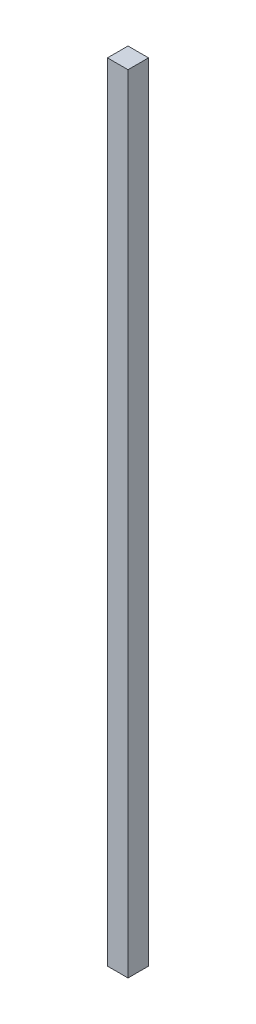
ISO-10303-21;
HEADER;
FILE_DESCRIPTION(('STEP AP214'),'2;1');
FILE_NAME('part.step','',(''),(''),'','','');
FILE_SCHEMA(('AUTOMOTIVE_DESIGN { 1 0 10303 214 1 1 1 1 }'));
ENDSEC;
DATA;
#1=APPLICATION_CONTEXT('core data for automotive mechanical design processes');
#2=APPLICATION_PROTOCOL_DEFINITION('international standard','automotive_design',2000,#1);
#3=PRODUCT_CONTEXT('',#1,'mechanical');
#4=PRODUCT('Part','Part','',(#3));
#5=PRODUCT_RELATED_PRODUCT_CATEGORY('part','',(#4));
#6=PRODUCT_DEFINITION_FORMATION('','',#4);
#7=PRODUCT_DEFINITION_CONTEXT('part definition',#1,'design');
#8=PRODUCT_DEFINITION('design','',#6,#7);
#9=PRODUCT_DEFINITION_SHAPE('','',#8);
#10=(LENGTH_UNIT() NAMED_UNIT(*) SI_UNIT(.MILLI.,.METRE.));
#11=(NAMED_UNIT(*) PLANE_ANGLE_UNIT() SI_UNIT($,.RADIAN.));
#12=(NAMED_UNIT(*) SI_UNIT($,.STERADIAN.) SOLID_ANGLE_UNIT());
#13=UNCERTAINTY_MEASURE_WITH_UNIT(LENGTH_MEASURE(1.E-05),#10,'distance_accuracy_value','');
#14=(GEOMETRIC_REPRESENTATION_CONTEXT(3) GLOBAL_UNCERTAINTY_ASSIGNED_CONTEXT((#13)) GLOBAL_UNIT_ASSIGNED_CONTEXT((#10,
#11,#12)) REPRESENTATION_CONTEXT('',''));
#15=CARTESIAN_POINT('',(0.,0.,0.));
#16=DIRECTION('',(0.,0.,1.));
#17=DIRECTION('',(1.,0.,0.));
#18=AXIS2_PLACEMENT_3D('',#15,#16,#17);
#19=CARTESIAN_POINT('',(30.,2300.,-30.));
#20=DIRECTION('',(-1.,0.,0.));
#21=DIRECTION('',(0.,0.,1.));
#22=AXIS2_PLACEMENT_3D('',#19,#20,#21);
#23=PLANE('',#22);
#24=DIRECTION('',(0.,0.,-1.));
#25=VECTOR('',#24,1.);
#26=CARTESIAN_POINT('',(30.,0.,-30.));
#27=LINE('',#26,#25);
#28=CARTESIAN_POINT('',(30.,0.,30.));
#29=VERTEX_POINT('',#28);
#30=CARTESIAN_POINT('',(30.,0.,-30.));
#31=VERTEX_POINT('',#30);
#32=EDGE_CURVE('E108',#29,#31,#27,.T.);
#33=ORIENTED_EDGE('',*,*,#32,.T.);
#34=DIRECTION('',(0.,-1.,0.));
#35=VECTOR('',#34,1.);
#36=CARTESIAN_POINT('',(30.,2300.,-30.));
#37=LINE('',#36,#35);
#38=CARTESIAN_POINT('',(30.,2300.,-30.));
#39=VERTEX_POINT('',#38);
#40=EDGE_CURVE('E11',#39,#31,#37,.T.);
#41=ORIENTED_EDGE('',*,*,#40,.F.);
#42=DIRECTION('',(0.,0.,-1.));
#43=VECTOR('',#42,1.);
#44=CARTESIAN_POINT('',(30.,2300.,-30.));
#45=LINE('',#44,#43);
#46=CARTESIAN_POINT('',(30.,2300.,30.));
#47=VERTEX_POINT('',#46);
#48=EDGE_CURVE('E96',#47,#39,#45,.T.);
#49=ORIENTED_EDGE('',*,*,#48,.F.);
#50=DIRECTION('',(0.,-1.,0.));
#51=VECTOR('',#50,1.);
#52=CARTESIAN_POINT('',(30.,2300.,30.));
#53=LINE('',#52,#51);
#54=EDGE_CURVE('E104',#47,#29,#53,.T.);
#55=ORIENTED_EDGE('',*,*,#54,.T.);
#56=EDGE_LOOP('',(#33,#41,#49,#55));
#57=FACE_BOUND('',#56,.T.);
#58=ADVANCED_FACE('F45',(#57),#23,.F.);
#59=CARTESIAN_POINT('',(-30.,2300.,-30.));
#60=DIRECTION('',(0.,0.,1.));
#61=DIRECTION('',(1.,0.,0.));
#62=AXIS2_PLACEMENT_3D('',#59,#60,#61);
#63=PLANE('',#62);
#64=DIRECTION('',(-1.,0.,0.));
#65=VECTOR('',#64,1.);
#66=CARTESIAN_POINT('',(-30.,0.,-30.));
#67=LINE('',#66,#65);
#68=CARTESIAN_POINT('',(-30.,0.,-30.));
#69=VERTEX_POINT('',#68);
#70=EDGE_CURVE('E100',#31,#69,#67,.T.);
#71=ORIENTED_EDGE('',*,*,#70,.T.);
#72=DIRECTION('',(0.,-1.,0.));
#73=VECTOR('',#72,1.);
#74=CARTESIAN_POINT('',(-30.,2300.,-30.));
#75=LINE('',#74,#73);
#76=CARTESIAN_POINT('',(-30.,2300.,-30.));
#77=VERTEX_POINT('',#76);
#78=EDGE_CURVE('E53',#77,#69,#75,.T.);
#79=ORIENTED_EDGE('',*,*,#78,.F.);
#80=DIRECTION('',(-1.,0.,0.));
#81=VECTOR('',#80,1.);
#82=CARTESIAN_POINT('',(-30.,2300.,-30.));
#83=LINE('',#82,#81);
#84=EDGE_CURVE('E91',#39,#77,#83,.T.);
#85=ORIENTED_EDGE('',*,*,#84,.F.);
#86=ORIENTED_EDGE('',*,*,#40,.T.);
#87=EDGE_LOOP('',(#71,#79,#85,#86));
#88=FACE_BOUND('',#87,.T.);
#89=ADVANCED_FACE('F99',(#88),#63,.F.);
#90=CARTESIAN_POINT('',(-30.,2300.,-30.));
#91=DIRECTION('',(1.,0.,0.));
#92=DIRECTION('',(0.,0.,-1.));
#93=AXIS2_PLACEMENT_3D('',#90,#91,#92);
#94=PLANE('',#93);
#95=DIRECTION('',(0.,0.,1.));
#96=VECTOR('',#95,1.);
#97=CARTESIAN_POINT('',(-30.,0.,-30.));
#98=LINE('',#97,#96);
#99=CARTESIAN_POINT('',(-30.,0.,30.));
#100=VERTEX_POINT('',#99);
#101=EDGE_CURVE('E78',#69,#100,#98,.T.);
#102=ORIENTED_EDGE('',*,*,#101,.T.);
#103=DIRECTION('',(0.,-1.,0.));
#104=VECTOR('',#103,1.);
#105=CARTESIAN_POINT('',(-30.,2300.,30.));
#106=LINE('',#105,#104);
#107=CARTESIAN_POINT('',(-30.,2300.,30.));
#108=VERTEX_POINT('',#107);
#109=EDGE_CURVE('E101',#108,#100,#106,.T.);
#110=ORIENTED_EDGE('',*,*,#109,.F.);
#111=DIRECTION('',(0.,0.,1.));
#112=VECTOR('',#111,1.);
#113=CARTESIAN_POINT('',(-30.,2300.,-30.));
#114=LINE('',#113,#112);
#115=EDGE_CURVE('E94',#77,#108,#114,.T.);
#116=ORIENTED_EDGE('',*,*,#115,.F.);
#117=ORIENTED_EDGE('',*,*,#78,.T.);
#118=EDGE_LOOP('',(#102,#110,#116,#117));
#119=FACE_BOUND('',#118,.T.);
#120=ADVANCED_FACE('F102',(#119),#94,.F.);
#121=CARTESIAN_POINT('',(-30.,2300.,30.));
#122=DIRECTION('',(0.,0.,-1.));
#123=DIRECTION('',(-1.,0.,0.));
#124=AXIS2_PLACEMENT_3D('',#121,#122,#123);
#125=PLANE('',#124);
#126=DIRECTION('',(1.,0.,0.));
#127=VECTOR('',#126,1.);
#128=CARTESIAN_POINT('',(-30.,0.,30.));
#129=LINE('',#128,#127);
#130=EDGE_CURVE('E84',#100,#29,#129,.T.);
#131=ORIENTED_EDGE('',*,*,#130,.T.);
#132=ORIENTED_EDGE('',*,*,#54,.F.);
#133=DIRECTION('',(1.,0.,0.));
#134=VECTOR('',#133,1.);
#135=CARTESIAN_POINT('',(-30.,2300.,30.));
#136=LINE('',#135,#134);
#137=EDGE_CURVE('E61',#108,#47,#136,.T.);
#138=ORIENTED_EDGE('',*,*,#137,.F.);
#139=ORIENTED_EDGE('',*,*,#109,.T.);
#140=EDGE_LOOP('',(#131,#132,#138,#139));
#141=FACE_BOUND('',#140,.T.);
#142=ADVANCED_FACE('F115',(#141),#125,.F.);
#143=CARTESIAN_POINT('',(0.,2300.,0.));
#144=DIRECTION('',(0.,1.,0.));
#145=DIRECTION('',(0.,0.,1.));
#146=AXIS2_PLACEMENT_3D('',#143,#144,#145);
#147=PLANE('',#146);
#148=ORIENTED_EDGE('',*,*,#48,.T.);
#149=ORIENTED_EDGE('',*,*,#84,.T.);
#150=ORIENTED_EDGE('',*,*,#115,.T.);
#151=ORIENTED_EDGE('',*,*,#137,.T.);
#152=EDGE_LOOP('',(#148,#149,#150,#151));
#153=FACE_BOUND('',#152,.T.);
#154=ADVANCED_FACE('F92',(#153),#147,.T.);
#155=CARTESIAN_POINT('',(0.,0.,0.));
#156=DIRECTION('',(0.,1.,0.));
#157=DIRECTION('',(0.,0.,1.));
#158=AXIS2_PLACEMENT_3D('',#155,#156,#157);
#159=PLANE('',#158);
#160=ORIENTED_EDGE('',*,*,#32,.F.);
#161=ORIENTED_EDGE('',*,*,#130,.F.);
#162=ORIENTED_EDGE('',*,*,#101,.F.);
#163=ORIENTED_EDGE('',*,*,#70,.F.);
#164=EDGE_LOOP('',(#160,#161,#162,#163));
#165=FACE_BOUND('',#164,.T.);
#166=ADVANCED_FACE('F118',(#165),#159,.F.);
#167=CLOSED_SHELL('',(#58,#89,#120,#142,#154,#166));
#168=MANIFOLD_SOLID_BREP('B2',#167);
#169=ADVANCED_BREP_SHAPE_REPRESENTATION('',(#18,#168),#14);
#170=SHAPE_DEFINITION_REPRESENTATION(#9,#169);
ENDSEC;
END-ISO-10303-21;
